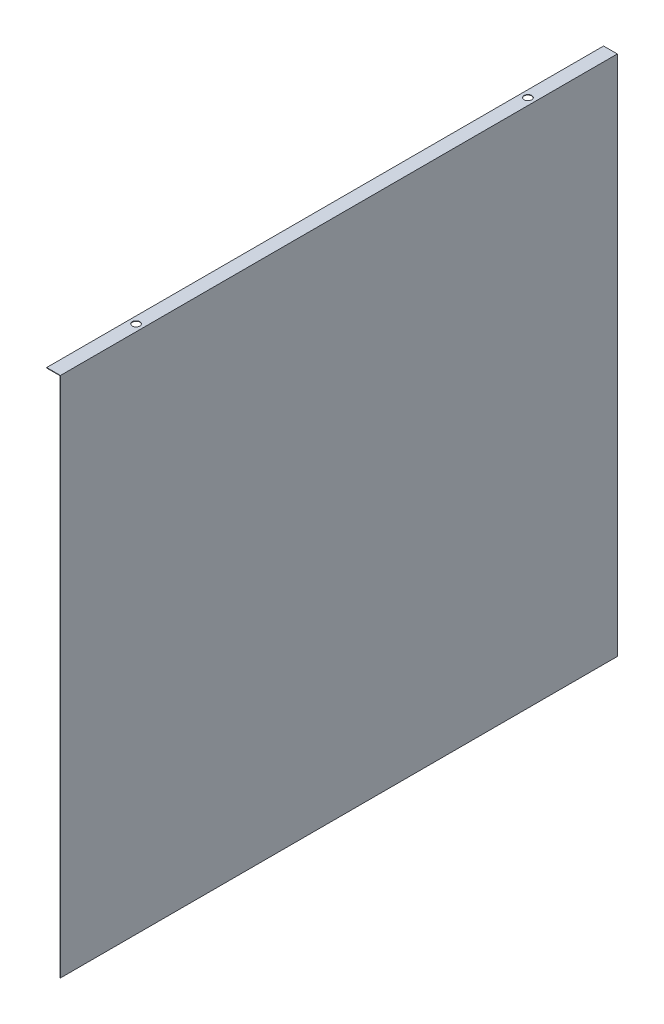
from build123d import *

# Parameters (mm, degrees)
EXTRUSION2_DEPTH        = 810
ESQUISSE2_R             = 5.5
ENL_V_MAT_EXTRU_1_DEPTH = 10


with BuildPart() as part:
    # Esquisse1 → Extrusion2 (new body)
    with BuildSketch(Plane.XY):
        Polygon((0, 0), (0, 759), (-20, 759), (-20, 758.3), (-0.7, 758.3), (-0.7, 0), align=None)
    extrude(amount=EXTRUSION2_DEPTH)

    # Esquisse2 → Enl_v. mat.-Extru.1 (cut)
    with BuildSketch(Plane(origin=(0, 759, 0), x_dir=(-1, 0, 0), z_dir=(0, 1, 0))):
        with Locations(Location((10, 120, 0), (0, 0, 90))):
            Circle(ESQUISSE2_R)
        with Locations(Location((10, 690, 0), (0, 0, 90))):
            Circle(ESQUISSE2_R)
    extrude(amount=-ENL_V_MAT_EXTRU_1_DEPTH, mode=Mode.SUBTRACT)


solid = part.part
